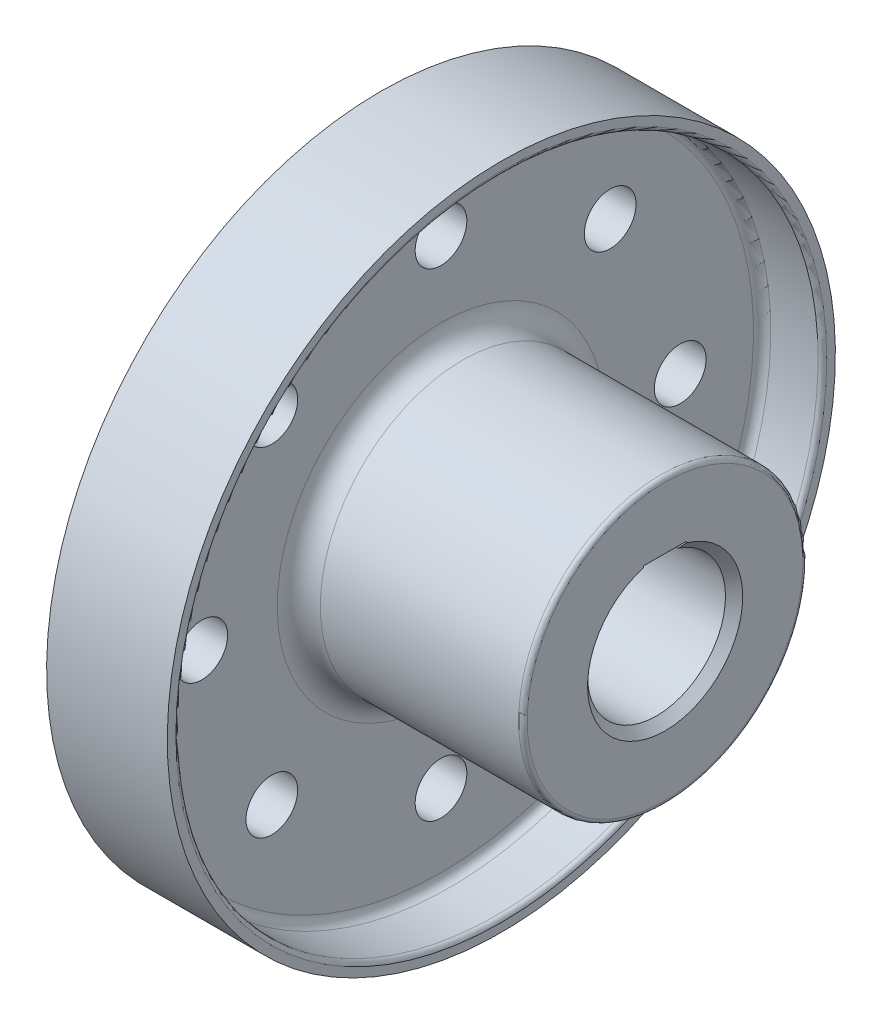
from build123d import *

# Parameters (mm, degrees)
SKETCH2_R          = 27.5
CUT_EXTRUDE1_DEPTH = 6
SKETCH3_R          = 16
SKETCH3_W          = 10
SKETCH3_H          = 3.3
CUT_EXTRUDE2_DEPTH = 125.949989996
CHAMFER1_SIZE      = 2
FILLET1_R          = 1
FILLET2_R          = 2
FILLET3_R          = 5
SKETCH4_R          = 6
CUT_EXTRUDE3_DEPTH = 128.939438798


with BuildPart() as part:
    # Sketch1 → Revolve1 (revolve)
    with BuildSketch(Plane.XY):
        Polygon((7.191635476, 0), (7.191635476, 33), (-44.808364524, 33), (-44.808364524, 74.5), (-30.808364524, 74.5), (-30.808364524, 77.5), (-58.808364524, 77.5), (-58.808364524, 0), align=None)
    revolve(axis=Axis((7.191635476, 0, 0), (-1, 0, 0)))

    # Sketch2 → Cut-Extrude1 (cut)
    with BuildSketch(Plane.ZY.offset(58.808364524)):
        with Locations(Location((0, 0, 0), (0, 0, 270))):
            Circle(SKETCH2_R)
    extrude(amount=-CUT_EXTRUDE1_DEPTH, mode=Mode.SUBTRACT)

    # Sketch3 → Cut-Extrude2 (cut, through all)
    with BuildSketch(Plane.ZY.offset(52.808364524)):
        Circle(SKETCH3_R)
        with Locations((0, 16)):
            Rectangle(SKETCH3_W, SKETCH3_H)
    extrude(amount=-CUT_EXTRUDE2_DEPTH, mode=Mode.SUBTRACT)

    # Chamfer1
    chamfer1_edges = [part.edges().sort_by_distance(p)[0] for p in [
        (7.191635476, -16, 0),
    ]]
    chamfer(chamfer1_edges, length=CHAMFER1_SIZE)

    # Fillet1
    fillet1_edges = [part.edges().sort_by_distance(p)[0] for p in [
        (-30.808364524, -74.5, 0),
        (7.191635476, -33, 0),
    ]]
    fillet(fillet1_edges, radius=FILLET1_R)

    # Fillet2
    fillet2_edges = [part.edges().sort_by_distance(p)[0] for p in [
        (-44.808364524, -74.5, 0),
    ]]
    fillet(fillet2_edges, radius=FILLET2_R)

    # Fillet3
    fillet3_edges = [part.edges().sort_by_distance(p)[0] for p in [
        (-44.808364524, -33, 0),
    ]]
    fillet(fillet3_edges, radius=FILLET3_R)

    # Sketch4 → Cut-Extrude3 (cut, through all)
    with BuildSketch(Plane.ZY.offset(58.808364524)):
        with Locations(Location((0, 55.5, 0), (0, 0, 270))):
            Circle(SKETCH4_R)
        with Locations(Location((39.244426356, 39.244426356, 0), (0, 0, 270))):
            Circle(SKETCH4_R)
        with Locations(Location((55.5, 0, 0), (0, 0, 270))):
            Circle(SKETCH4_R)
        with Locations(Location((39.244426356, -39.244426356, 0), (0, 0, 270))):
            Circle(SKETCH4_R)
        with Locations(Location((0, -55.5, 0), (0, 0, 270))):
            Circle(SKETCH4_R)
        with Locations(Location((-39.244426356, -39.244426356, 0), (0, 0, 270))):
            Circle(SKETCH4_R)
        with Locations(Location((-55.5, 0, 0), (0, 0, 270))):
            Circle(SKETCH4_R)
        with Locations(Location((-39.244426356, 39.244426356, 0), (0, 0, 270))):
            Circle(SKETCH4_R)
    extrude(amount=-CUT_EXTRUDE3_DEPTH, mode=Mode.SUBTRACT)


solid = part.part
